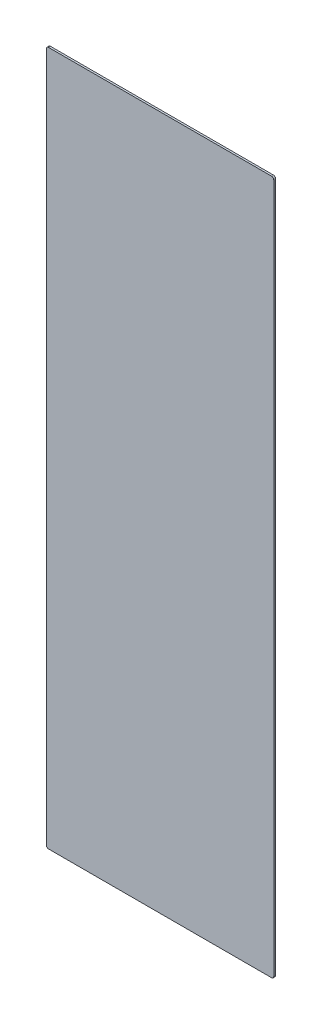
from build123d import *

# Parameters (mm, degrees)
SKETCH1_W           = 4
SKETCH1_H           = 1526
BOSS_EXTRUDE1_DEPTH = 250
FILLET1_R           = 5
BOSS_EXTRUDE2_DEPTH = 0.25
CUT_EXTRUDE1_DEPTH  = 0.25


with BuildPart() as part:
    # Sketch1 → Boss-Extrude1 (new, symmetric)
    with BuildSketch(Plane(origin=(0, 0, 0), x_dir=(0, 0, -1), z_dir=(1, 0, 0))):
        Rectangle(SKETCH1_W, SKETCH1_H)
    extrude(amount=BOSS_EXTRUDE1_DEPTH, both=True)

    # Fillet1
    fillet1_edges = [part.edges().sort_by_distance(p)[0] for p in [
        (250, -763, 0),
        (-250, -763, 0),
        (-250, 763, 0),
        (250, 763, 0),
    ]]
    fillet(fillet1_edges, radius=FILLET1_R)

    # Sketch2 → Boss-Extrude2 (add)
    with BuildSketch(Plane(origin=(0, 0, -2), x_dir=(-1, 0, 0), z_dir=(0, 0, -1))):
        with BuildLine():
            Line((-250, 758), (-250, -758))
            ThreePointArc((-250, -758), (-248.535533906, -761.535533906), (-245, -763))
            Line((-245, -763), (245, -763))
            ThreePointArc((245, -763), (248.535533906, -761.535533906), (250, -758))
            Line((250, -758), (250, 758))
            ThreePointArc((250, 758), (248.535533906, 761.535533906), (245, 763))
            Line((245, 763), (-245, 763))
            ThreePointArc((-245, 763), (-248.535533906, 761.535533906), (-250, 758))
        make_face()
    extrude(amount=BOSS_EXTRUDE2_DEPTH)

    # Sketch3 → Cut-Extrude1 (cut)
    with BuildSketch(Plane(origin=(0, 0, -2.25), x_dir=(-1, 0, 0), z_dir=(0, 0, -1))):
        with BuildLine():
            Line((-185, 722.5), (185, 722.5))
            ThreePointArc((185, 722.5), (202.67766953, 715.17766953), (210, 697.5))
            Line((210, 697.5), (210, -697.5))
            ThreePointArc((210, -697.5), (202.67766953, -715.17766953), (185, -722.5))
            Line((185, -722.5), (-185, -722.5))
            ThreePointArc((-185, -722.5), (-202.67766953, -715.17766953), (-210, -697.5))
            Line((-210, -697.5), (-210, 697.5))
            ThreePointArc((-210, 697.5), (-202.67766953, 715.17766953), (-185, 722.5))
        make_face()
    extrude(amount=-CUT_EXTRUDE1_DEPTH, mode=Mode.SUBTRACT)


solid = part.part
